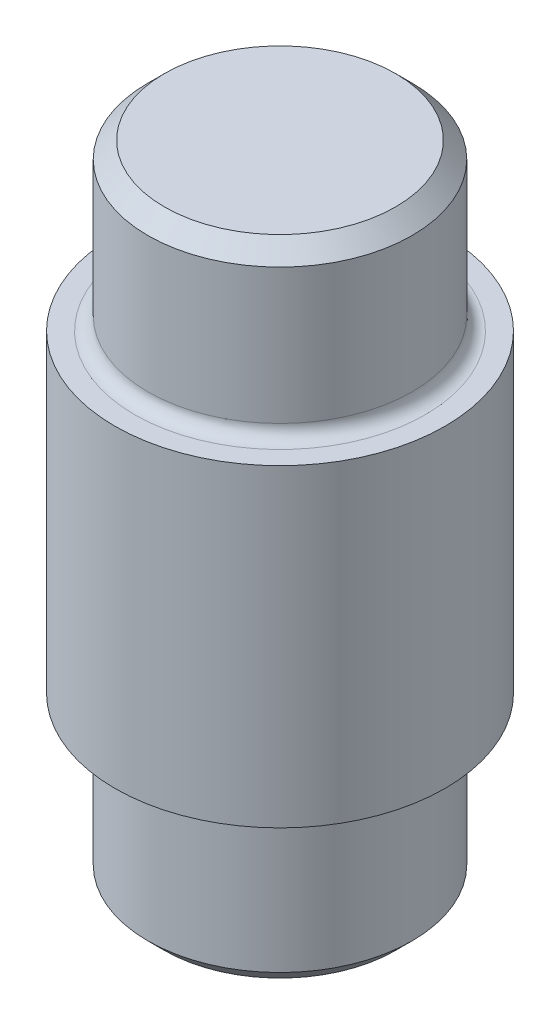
ISO-10303-21;
HEADER;
FILE_DESCRIPTION(('STEP AP214'),'2;1');
FILE_NAME('part.step','',(''),(''),'','','');
FILE_SCHEMA(('AUTOMOTIVE_DESIGN { 1 0 10303 214 1 1 1 1 }'));
ENDSEC;
DATA;
#1=APPLICATION_CONTEXT('core data for automotive mechanical design processes');
#2=APPLICATION_PROTOCOL_DEFINITION('international standard','automotive_design',2000,#1);
#3=PRODUCT_CONTEXT('',#1,'mechanical');
#4=PRODUCT('Part','Part','',(#3));
#5=PRODUCT_RELATED_PRODUCT_CATEGORY('part','',(#4));
#6=PRODUCT_DEFINITION_FORMATION('','',#4);
#7=PRODUCT_DEFINITION_CONTEXT('part definition',#1,'design');
#8=PRODUCT_DEFINITION('design','',#6,#7);
#9=PRODUCT_DEFINITION_SHAPE('','',#8);
#10=(LENGTH_UNIT() NAMED_UNIT(*) SI_UNIT(.MILLI.,.METRE.));
#11=(NAMED_UNIT(*) PLANE_ANGLE_UNIT() SI_UNIT($,.RADIAN.));
#12=(NAMED_UNIT(*) SI_UNIT($,.STERADIAN.) SOLID_ANGLE_UNIT());
#13=UNCERTAINTY_MEASURE_WITH_UNIT(LENGTH_MEASURE(1.E-05),#10,'distance_accuracy_value','');
#14=(GEOMETRIC_REPRESENTATION_CONTEXT(3) GLOBAL_UNCERTAINTY_ASSIGNED_CONTEXT((#13)) GLOBAL_UNIT_ASSIGNED_CONTEXT((#10,
#11,#12)) REPRESENTATION_CONTEXT('',''));
#15=CARTESIAN_POINT('',(0.,0.,0.));
#16=DIRECTION('',(0.,0.,1.));
#17=DIRECTION('',(1.,0.,0.));
#18=AXIS2_PLACEMENT_3D('',#15,#16,#17);
#19=CARTESIAN_POINT('',(0.,0.,0.));
#20=DIRECTION('',(0.,-1.,0.));
#21=DIRECTION('',(0.,0.,-1.));
#22=AXIS2_PLACEMENT_3D('',#19,#20,#21);
#23=PLANE('',#22);
#24=CARTESIAN_POINT('',(0.,0.,0.));
#25=DIRECTION('',(0.,-1.,0.));
#26=DIRECTION('',(0.,0.,-1.));
#27=AXIS2_PLACEMENT_3D('',#24,#25,#26);
#28=CIRCLE('',#27,3.49999999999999);
#29=CARTESIAN_POINT('',(0.,0.,-3.49999999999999));
#30=VERTEX_POINT('',#29);
#31=EDGE_CURVE('E46',#30,#30,#28,.T.);
#32=ORIENTED_EDGE('',*,*,#31,.T.);
#33=EDGE_LOOP('',(#32));
#34=FACE_BOUND('',#33,.T.);
#35=ADVANCED_FACE('F27',(#34),#23,.T.);
#36=CARTESIAN_POINT('',(0.,40.,0.));
#37=DIRECTION('',(0.,1.,0.));
#38=DIRECTION('',(0.,0.,1.));
#39=AXIS2_PLACEMENT_3D('',#36,#37,#38);
#40=CYLINDRICAL_SURFACE('',#39,3.99999999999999);
#41=CARTESIAN_POINT('',(0.,4.6,0.));
#42=DIRECTION('',(0.,-1.,0.));
#43=DIRECTION('',(0.,0.,-1.));
#44=AXIS2_PLACEMENT_3D('',#41,#42,#43);
#45=CIRCLE('',#44,3.99999999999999);
#46=CARTESIAN_POINT('',(0.,4.6,-3.99999999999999));
#47=VERTEX_POINT('',#46);
#48=EDGE_CURVE('E10',#47,#47,#45,.T.);
#49=ORIENTED_EDGE('',*,*,#48,.T.);
#50=EDGE_LOOP('',(#49));
#51=FACE_BOUND('',#50,.T.);
#52=CARTESIAN_POINT('',(0.,0.500000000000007,0.));
#53=DIRECTION('',(0.,-1.,0.));
#54=DIRECTION('',(0.,0.,-1.));
#55=AXIS2_PLACEMENT_3D('',#52,#53,#54);
#56=CIRCLE('',#55,3.99999999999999);
#57=CARTESIAN_POINT('',(0.,0.500000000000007,-3.99999999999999));
#58=VERTEX_POINT('',#57);
#59=EDGE_CURVE('E49',#58,#58,#56,.F.);
#60=ORIENTED_EDGE('',*,*,#59,.T.);
#61=EDGE_LOOP('',(#60));
#62=FACE_BOUND('',#61,.T.);
#63=ADVANCED_FACE('F79',(#51,#62),#40,.T.);
#64=CARTESIAN_POINT('',(-3.99999999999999,5.,0.));
#65=DIRECTION('',(0.,-1.,0.));
#66=DIRECTION('',(0.,0.,-1.));
#67=AXIS2_PLACEMENT_3D('',#64,#65,#66);
#68=PLANE('',#67);
#69=CARTESIAN_POINT('',(0.,5.,0.));
#70=DIRECTION('',(0.,-1.,0.));
#71=DIRECTION('',(0.,0.,-1.));
#72=AXIS2_PLACEMENT_3D('',#69,#70,#71);
#73=CIRCLE('',#72,4.4);
#74=CARTESIAN_POINT('',(0.,5.,-4.4));
#75=VERTEX_POINT('',#74);
#76=EDGE_CURVE('E33',#75,#75,#73,.F.);
#77=ORIENTED_EDGE('',*,*,#76,.T.);
#78=EDGE_LOOP('',(#77));
#79=FACE_BOUND('',#78,.T.);
#80=CARTESIAN_POINT('',(0.,5.,0.));
#81=DIRECTION('',(0.,1.,0.));
#82=DIRECTION('',(0.,0.,1.));
#83=AXIS2_PLACEMENT_3D('',#80,#81,#82);
#84=CIRCLE('',#83,5.);
#85=CARTESIAN_POINT('',(0.,5.,5.));
#86=VERTEX_POINT('',#85);
#87=EDGE_CURVE('E58',#86,#86,#84,.T.);
#88=ORIENTED_EDGE('',*,*,#87,.F.);
#89=EDGE_LOOP('',(#88));
#90=FACE_BOUND('',#89,.T.);
#91=ADVANCED_FACE('F69',(#79,#90),#68,.T.);
#92=CARTESIAN_POINT('',(0.,40.,0.));
#93=DIRECTION('',(0.,1.,0.));
#94=DIRECTION('',(0.,0.,1.));
#95=AXIS2_PLACEMENT_3D('',#92,#93,#94);
#96=CYLINDRICAL_SURFACE('',#95,5.);
#97=ORIENTED_EDGE('',*,*,#87,.T.);
#98=EDGE_LOOP('',(#97));
#99=FACE_BOUND('',#98,.T.);
#100=CARTESIAN_POINT('',(0.,14.5,0.));
#101=DIRECTION('',(0.,1.,0.));
#102=DIRECTION('',(0.,0.,1.));
#103=AXIS2_PLACEMENT_3D('',#100,#101,#102);
#104=CIRCLE('',#103,5.);
#105=CARTESIAN_POINT('',(0.,14.5,5.));
#106=VERTEX_POINT('',#105);
#107=EDGE_CURVE('E61',#106,#106,#104,.T.);
#108=ORIENTED_EDGE('',*,*,#107,.F.);
#109=EDGE_LOOP('',(#108));
#110=FACE_BOUND('',#109,.T.);
#111=ADVANCED_FACE('F67',(#99,#110),#96,.T.);
#112=CARTESIAN_POINT('',(-5.,14.5,0.));
#113=DIRECTION('',(0.,1.,0.));
#114=DIRECTION('',(0.,0.,1.));
#115=AXIS2_PLACEMENT_3D('',#112,#113,#114);
#116=PLANE('',#115);
#117=CARTESIAN_POINT('',(0.,14.5,0.));
#118=DIRECTION('',(0.,1.,0.));
#119=DIRECTION('',(0.,0.,1.));
#120=AXIS2_PLACEMENT_3D('',#117,#118,#119);
#121=CIRCLE('',#120,4.39999999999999);
#122=CARTESIAN_POINT('',(0.,14.5,4.39999999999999));
#123=VERTEX_POINT('',#122);
#124=EDGE_CURVE('E37',#123,#123,#121,.F.);
#125=ORIENTED_EDGE('',*,*,#124,.T.);
#126=EDGE_LOOP('',(#125));
#127=FACE_BOUND('',#126,.T.);
#128=ORIENTED_EDGE('',*,*,#107,.T.);
#129=EDGE_LOOP('',(#128));
#130=FACE_BOUND('',#129,.T.);
#131=ADVANCED_FACE('F65',(#127,#130),#116,.T.);
#132=CARTESIAN_POINT('',(0.,40.,0.));
#133=DIRECTION('',(0.,1.,0.));
#134=DIRECTION('',(0.,0.,1.));
#135=AXIS2_PLACEMENT_3D('',#132,#133,#134);
#136=CYLINDRICAL_SURFACE('',#135,3.99999999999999);
#137=CARTESIAN_POINT('',(0.,14.9,0.));
#138=DIRECTION('',(0.,1.,0.));
#139=DIRECTION('',(0.,0.,1.));
#140=AXIS2_PLACEMENT_3D('',#137,#138,#139);
#141=CIRCLE('',#140,3.99999999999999);
#142=CARTESIAN_POINT('',(0.,14.9,3.99999999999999));
#143=VERTEX_POINT('',#142);
#144=EDGE_CURVE('E41',#143,#143,#141,.T.);
#145=ORIENTED_EDGE('',*,*,#144,.T.);
#146=EDGE_LOOP('',(#145));
#147=FACE_BOUND('',#146,.T.);
#148=CARTESIAN_POINT('',(0.,19.,0.));
#149=DIRECTION('',(0.,1.,0.));
#150=DIRECTION('',(0.,0.,1.));
#151=AXIS2_PLACEMENT_3D('',#148,#149,#150);
#152=CIRCLE('',#151,3.99999999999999);
#153=CARTESIAN_POINT('',(0.,19.,3.99999999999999));
#154=VERTEX_POINT('',#153);
#155=EDGE_CURVE('E52',#154,#154,#152,.F.);
#156=ORIENTED_EDGE('',*,*,#155,.T.);
#157=EDGE_LOOP('',(#156));
#158=FACE_BOUND('',#157,.T.);
#159=ADVANCED_FACE('F76',(#147,#158),#136,.T.);
#160=CARTESIAN_POINT('',(-3.99999999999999,19.5,0.));
#161=DIRECTION('',(0.,1.,0.));
#162=DIRECTION('',(0.,0.,1.));
#163=AXIS2_PLACEMENT_3D('',#160,#161,#162);
#164=PLANE('',#163);
#165=CARTESIAN_POINT('',(0.,19.5,0.));
#166=DIRECTION('',(0.,1.,0.));
#167=DIRECTION('',(0.,0.,1.));
#168=AXIS2_PLACEMENT_3D('',#165,#166,#167);
#169=CIRCLE('',#168,3.49999999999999);
#170=CARTESIAN_POINT('',(0.,19.5,3.49999999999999));
#171=VERTEX_POINT('',#170);
#172=EDGE_CURVE('E55',#171,#171,#169,.T.);
#173=ORIENTED_EDGE('',*,*,#172,.T.);
#174=EDGE_LOOP('',(#173));
#175=FACE_BOUND('',#174,.T.);
#176=ADVANCED_FACE('F103',(#175),#164,.T.);
#177=CARTESIAN_POINT('',(0.,19.5,0.));
#178=DIRECTION('',(0.,-1.,0.));
#179=DIRECTION('',(0.,0.,-1.));
#180=AXIS2_PLACEMENT_3D('',#177,#178,#179);
#181=CONICAL_SURFACE('',#180,3.49999999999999,0.785398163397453);
#182=ORIENTED_EDGE('',*,*,#155,.F.);
#183=EDGE_LOOP('',(#182));
#184=FACE_BOUND('',#183,.T.);
#185=ORIENTED_EDGE('',*,*,#172,.F.);
#186=EDGE_LOOP('',(#185));
#187=FACE_BOUND('',#186,.T.);
#188=ADVANCED_FACE('F92',(#184,#187),#181,.T.);
#189=CARTESIAN_POINT('',(0.,0.500000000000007,0.));
#190=DIRECTION('',(0.,1.,0.));
#191=DIRECTION('',(0.,0.,1.));
#192=AXIS2_PLACEMENT_3D('',#189,#190,#191);
#193=CONICAL_SURFACE('',#192,3.99999999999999,0.785398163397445);
#194=ORIENTED_EDGE('',*,*,#31,.F.);
#195=EDGE_LOOP('',(#194));
#196=FACE_BOUND('',#195,.T.);
#197=ORIENTED_EDGE('',*,*,#59,.F.);
#198=EDGE_LOOP('',(#197));
#199=FACE_BOUND('',#198,.T.);
#200=ADVANCED_FACE('F88',(#196,#199),#193,.T.);
#201=CARTESIAN_POINT('',(0.,14.9,0.));
#202=DIRECTION('',(0.,1.,0.));
#203=DIRECTION('',(0.,0.,1.));
#204=AXIS2_PLACEMENT_3D('',#201,#202,#203);
#205=TOROIDAL_SURFACE('',#204,4.39999999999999,0.4);
#206=ORIENTED_EDGE('',*,*,#124,.F.);
#207=EDGE_LOOP('',(#206));
#208=FACE_BOUND('',#207,.T.);
#209=ORIENTED_EDGE('',*,*,#144,.F.);
#210=EDGE_LOOP('',(#209));
#211=FACE_BOUND('',#210,.T.);
#212=ADVANCED_FACE('F91',(#208,#211),#205,.F.);
#213=CARTESIAN_POINT('',(0.,4.6,0.));
#214=DIRECTION('',(0.,-1.,0.));
#215=DIRECTION('',(0.,0.,-1.));
#216=AXIS2_PLACEMENT_3D('',#213,#214,#215);
#217=TOROIDAL_SURFACE('',#216,4.4,0.4);
#218=ORIENTED_EDGE('',*,*,#48,.F.);
#219=EDGE_LOOP('',(#218));
#220=FACE_BOUND('',#219,.T.);
#221=ORIENTED_EDGE('',*,*,#76,.F.);
#222=EDGE_LOOP('',(#221));
#223=FACE_BOUND('',#222,.T.);
#224=ADVANCED_FACE('F100',(#220,#223),#217,.F.);
#225=CLOSED_SHELL('',(#35,#63,#91,#111,#131,#159,#176,#188,#200,#212,#224));
#226=MANIFOLD_SOLID_BREP('B2',#225);
#227=ADVANCED_BREP_SHAPE_REPRESENTATION('',(#18,#226),#14);
#228=SHAPE_DEFINITION_REPRESENTATION(#9,#227);
ENDSEC;
END-ISO-10303-21;
